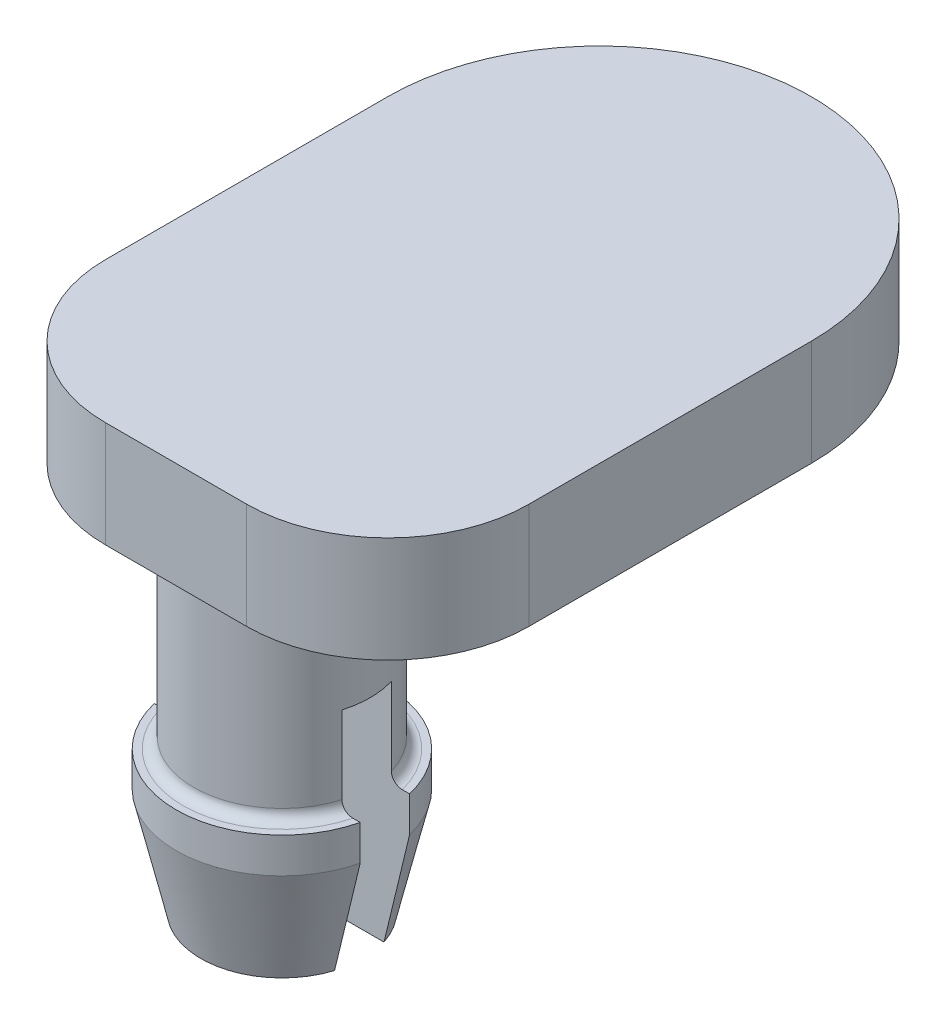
from build123d import *

# Parameters (mm, degrees)
BOSS_EXTRU_1_DEPTH      = 3
ESQUISSE2_R             = 2.5
BOSS_EXTRU_2_DEPTH      = 5.5
ESQUISSE3_R             = 3
BOSS_EXTRU_3_DEPTH      = 4
CONG_1_R                = 0.3
CHANFREIN2_SIZE         = 3
CHANFREIN2_SIZE2        = 0.7
ESQUISSE4_W             = 7.409115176
ESQUISSE4_H             = 1.4
ENL_V_MAT_EXTRU_1_DEPTH = 6.5


with BuildPart() as part:
    # Esquisse1 → Boss.-Extru.1 (new body)
    with BuildSketch(Plane.XZ):
        with BuildLine():
            Line((-2, 3), (2, 3))
            ThreePointArc((2, 3), (4.828427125, 1.828427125), (6, -1))
            Line((6, -1), (6, -9))
            ThreePointArc((6, -9), (0, -15), (-6, -9))
            Line((-6, -9), (-6, -1))
            ThreePointArc((-6, -1), (-4.828427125, 1.828427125), (-2, 3))
        make_face()
    extrude(amount=-BOSS_EXTRU_1_DEPTH)

    # Esquisse2 → Boss.-Extru.2 (add)
    with BuildSketch(Plane.XZ):
        with Locations(Location((0, 0, 0), (0, 0, 270))):
            Circle(ESQUISSE2_R)
    extrude(amount=BOSS_EXTRU_2_DEPTH)

    # Esquisse3 → Boss.-Extru.3 (add)
    with BuildSketch(Plane.XZ.offset(5.5)):
        with Locations(Location((0, 0, 0), (0, 0, 270))):
            Circle(ESQUISSE3_R)
    extrude(amount=BOSS_EXTRU_3_DEPTH)

    # Cong_1
    cong_1_edges = [part.edges().sort_by_distance(p)[0] for p in [
        (0, 0, 2.5),
        (0, -5.5, 2.5),
    ]]
    fillet(cong_1_edges, radius=CONG_1_R)

    # Chanfrein2
    chanfrein2_edges = [part.edges().sort_by_distance(p)[0] for p in [
        (0, -9.5, 3),
    ]]
    chanfrein2_side = [part.faces().sort_by_distance(p)[0] for p in [
        (0, -7.5, 3),
    ]]
    chamfer(chanfrein2_edges, length=CHANFREIN2_SIZE, length2=CHANFREIN2_SIZE2, reference=chanfrein2_side[0])

    # Esquisse4 → Enl_v. mat.-Extru.1 (cut)
    with BuildSketch(Plane(origin=(0, -9.5, 0), x_dir=(-1, 0, 0), z_dir=(0, -1, 0))):
        Rectangle(ESQUISSE4_W, ESQUISSE4_H)
    extrude(amount=-ENL_V_MAT_EXTRU_1_DEPTH, mode=Mode.SUBTRACT)


solid = part.part
